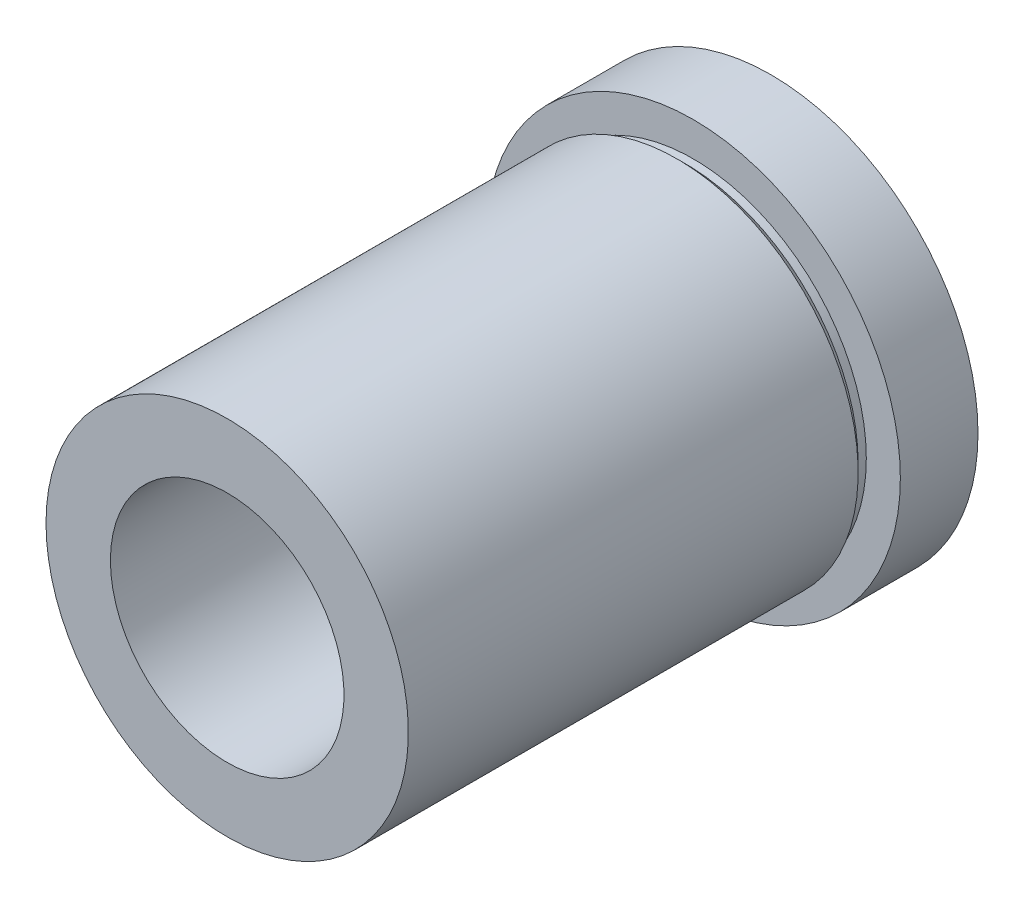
from build123d import *


with BuildPart() as part:
    # Logo3_bib1 → Revolve1 (revolve)
    with BuildSketch(Plane(origin=(0, 0, 0), x_dir=(-1, 0, 0), z_dir=(0, -1, 0))):
        Polygon((7.1628, -28.5873698), (11.1125, -28.5873698), (11.1125, -1), (10.6125, -0.5), (10.6125, 0), (12.7, 0), (12.7, 4.7625), (7.1628, 4.7625), align=None)
    revolve(axis=Axis((0, 0, -41.537203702), (0, 0, 1)))


solid = part.part
